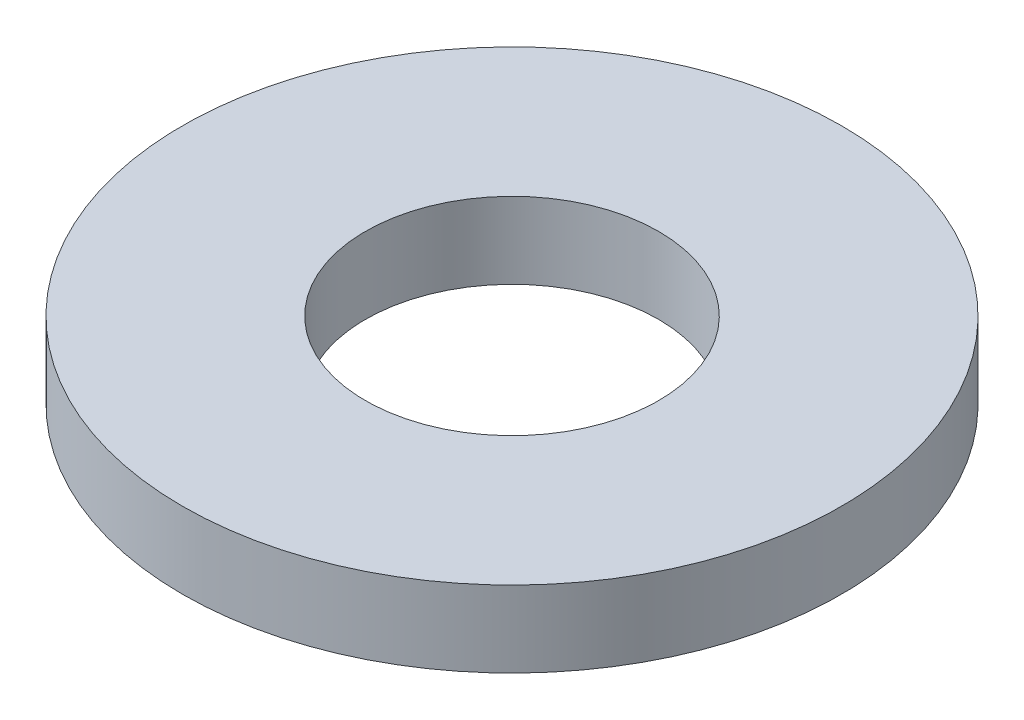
from build123d import *

# Parameters (mm, degrees)
SKETCH1_R           = 7.1374
SKETCH1_R_2         = 3.175
BOSS_EXTRUDE1_DEPTH = 1.651


with BuildPart() as part:
    # Sketch1 → Boss-Extrude1 (new body)
    with BuildSketch(Plane(origin=(0, 0, 0), x_dir=(1, 0, 0), z_dir=(0, 1, 0))):
        with Locations(Location((0, 0, 0), (0, 0, 90))):
            Circle(SKETCH1_R)
        with Locations(Location((0, 0, 0), (0, 0, 90))):
            Circle(SKETCH1_R_2, mode=Mode.SUBTRACT)
    extrude(amount=BOSS_EXTRUDE1_DEPTH)


solid = part.part
